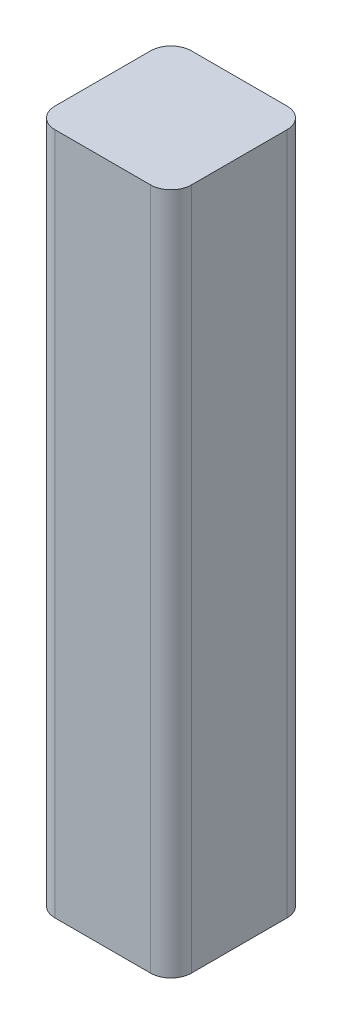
ISO-10303-21;
HEADER;
FILE_DESCRIPTION(('STEP AP214'),'2;1');
FILE_NAME('part.step','',(''),(''),'','','');
FILE_SCHEMA(('AUTOMOTIVE_DESIGN { 1 0 10303 214 1 1 1 1 }'));
ENDSEC;
DATA;
#1=APPLICATION_CONTEXT('core data for automotive mechanical design processes');
#2=APPLICATION_PROTOCOL_DEFINITION('international standard','automotive_design',2000,#1);
#3=PRODUCT_CONTEXT('',#1,'mechanical');
#4=PRODUCT('Part','Part','',(#3));
#5=PRODUCT_RELATED_PRODUCT_CATEGORY('part','',(#4));
#6=PRODUCT_DEFINITION_FORMATION('','',#4);
#7=PRODUCT_DEFINITION_CONTEXT('part definition',#1,'design');
#8=PRODUCT_DEFINITION('design','',#6,#7);
#9=PRODUCT_DEFINITION_SHAPE('','',#8);
#10=(LENGTH_UNIT() NAMED_UNIT(*) SI_UNIT(.MILLI.,.METRE.));
#11=(NAMED_UNIT(*) PLANE_ANGLE_UNIT() SI_UNIT($,.RADIAN.));
#12=(NAMED_UNIT(*) SI_UNIT($,.STERADIAN.) SOLID_ANGLE_UNIT());
#13=UNCERTAINTY_MEASURE_WITH_UNIT(LENGTH_MEASURE(1.E-05),#10,'distance_accuracy_value','');
#14=(GEOMETRIC_REPRESENTATION_CONTEXT(3) GLOBAL_UNCERTAINTY_ASSIGNED_CONTEXT((#13)) GLOBAL_UNIT_ASSIGNED_CONTEXT((#10,
#11,#12)) REPRESENTATION_CONTEXT('',''));
#15=CARTESIAN_POINT('',(0.,0.,0.));
#16=DIRECTION('',(0.,0.,1.));
#17=DIRECTION('',(1.,0.,0.));
#18=AXIS2_PLACEMENT_3D('',#15,#16,#17);
#19=CARTESIAN_POINT('',(-10.,100.,10.));
#20=DIRECTION('',(1.,0.,0.));
#21=DIRECTION('',(0.,0.,-1.));
#22=AXIS2_PLACEMENT_3D('',#19,#20,#21);
#23=PLANE('',#22);
#24=DIRECTION('',(0.,0.,1.));
#25=VECTOR('',#24,1.);
#26=CARTESIAN_POINT('',(-10.,0.,10.));
#27=LINE('',#26,#25);
#28=CARTESIAN_POINT('',(-10.,0.,-7.));
#29=VERTEX_POINT('',#28);
#30=CARTESIAN_POINT('',(-10.,0.,7.));
#31=VERTEX_POINT('',#30);
#32=EDGE_CURVE('E182',#29,#31,#27,.T.);
#33=ORIENTED_EDGE('',*,*,#32,.T.);
#34=DIRECTION('',(0.,-1.,0.));
#35=VECTOR('',#34,1.);
#36=CARTESIAN_POINT('',(-10.,100.,7.));
#37=LINE('',#36,#35);
#38=CARTESIAN_POINT('',(-10.,100.,7.));
#39=VERTEX_POINT('',#38);
#40=EDGE_CURVE('E11',#31,#39,#37,.F.);
#41=ORIENTED_EDGE('',*,*,#40,.T.);
#42=DIRECTION('',(0.,0.,1.));
#43=VECTOR('',#42,1.);
#44=CARTESIAN_POINT('',(-10.,100.,10.));
#45=LINE('',#44,#43);
#46=CARTESIAN_POINT('',(-10.,100.,-7.));
#47=VERTEX_POINT('',#46);
#48=EDGE_CURVE('E135',#47,#39,#45,.T.);
#49=ORIENTED_EDGE('',*,*,#48,.F.);
#50=DIRECTION('',(0.,-1.,0.));
#51=VECTOR('',#50,1.);
#52=CARTESIAN_POINT('',(-10.,100.,-7.));
#53=LINE('',#52,#51);
#54=EDGE_CURVE('E48',#47,#29,#53,.T.);
#55=ORIENTED_EDGE('',*,*,#54,.T.);
#56=EDGE_LOOP('',(#33,#41,#49,#55));
#57=FACE_BOUND('',#56,.T.);
#58=ADVANCED_FACE('F39',(#57),#23,.F.);
#59=CARTESIAN_POINT('',(10.,100.,10.));
#60=DIRECTION('',(0.,0.,-1.));
#61=DIRECTION('',(-1.,0.,0.));
#62=AXIS2_PLACEMENT_3D('',#59,#60,#61);
#63=PLANE('',#62);
#64=DIRECTION('',(1.,0.,0.));
#65=VECTOR('',#64,1.);
#66=CARTESIAN_POINT('',(10.,0.,10.));
#67=LINE('',#66,#65);
#68=CARTESIAN_POINT('',(-7.,0.,10.));
#69=VERTEX_POINT('',#68);
#70=CARTESIAN_POINT('',(7.,0.,10.));
#71=VERTEX_POINT('',#70);
#72=EDGE_CURVE('E142',#69,#71,#67,.T.);
#73=ORIENTED_EDGE('',*,*,#72,.T.);
#74=DIRECTION('',(0.,-1.,0.));
#75=VECTOR('',#74,1.);
#76=CARTESIAN_POINT('',(7.,100.,10.));
#77=LINE('',#76,#75);
#78=CARTESIAN_POINT('',(7.,100.,10.));
#79=VERTEX_POINT('',#78);
#80=EDGE_CURVE('E55',#71,#79,#77,.F.);
#81=ORIENTED_EDGE('',*,*,#80,.T.);
#82=DIRECTION('',(1.,0.,0.));
#83=VECTOR('',#82,1.);
#84=CARTESIAN_POINT('',(10.,100.,10.));
#85=LINE('',#84,#83);
#86=CARTESIAN_POINT('',(-7.,100.,10.));
#87=VERTEX_POINT('',#86);
#88=EDGE_CURVE('E140',#87,#79,#85,.T.);
#89=ORIENTED_EDGE('',*,*,#88,.F.);
#90=DIRECTION('',(0.,-1.,0.));
#91=VECTOR('',#90,1.);
#92=CARTESIAN_POINT('',(-7.,100.,10.));
#93=LINE('',#92,#91);
#94=EDGE_CURVE('E171',#87,#69,#93,.T.);
#95=ORIENTED_EDGE('',*,*,#94,.T.);
#96=EDGE_LOOP('',(#73,#81,#89,#95));
#97=FACE_BOUND('',#96,.T.);
#98=ADVANCED_FACE('F207',(#97),#63,.F.);
#99=CARTESIAN_POINT('',(10.,100.,10.));
#100=DIRECTION('',(-1.,0.,0.));
#101=DIRECTION('',(0.,0.,1.));
#102=AXIS2_PLACEMENT_3D('',#99,#100,#101);
#103=PLANE('',#102);
#104=DIRECTION('',(0.,0.,-1.));
#105=VECTOR('',#104,1.);
#106=CARTESIAN_POINT('',(10.,0.,10.));
#107=LINE('',#106,#105);
#108=CARTESIAN_POINT('',(10.,0.,7.));
#109=VERTEX_POINT('',#108);
#110=CARTESIAN_POINT('',(10.,0.,-7.));
#111=VERTEX_POINT('',#110);
#112=EDGE_CURVE('E136',#109,#111,#107,.T.);
#113=ORIENTED_EDGE('',*,*,#112,.T.);
#114=DIRECTION('',(0.,-1.,0.));
#115=VECTOR('',#114,1.);
#116=CARTESIAN_POINT('',(10.,100.,-7.));
#117=LINE('',#116,#115);
#118=CARTESIAN_POINT('',(10.,100.,-7.));
#119=VERTEX_POINT('',#118);
#120=EDGE_CURVE('E111',#111,#119,#117,.F.);
#121=ORIENTED_EDGE('',*,*,#120,.T.);
#122=DIRECTION('',(0.,0.,-1.));
#123=VECTOR('',#122,1.);
#124=CARTESIAN_POINT('',(10.,100.,10.));
#125=LINE('',#124,#123);
#126=CARTESIAN_POINT('',(10.,100.,7.));
#127=VERTEX_POINT('',#126);
#128=EDGE_CURVE('E193',#127,#119,#125,.T.);
#129=ORIENTED_EDGE('',*,*,#128,.F.);
#130=DIRECTION('',(0.,-1.,0.));
#131=VECTOR('',#130,1.);
#132=CARTESIAN_POINT('',(10.,100.,7.));
#133=LINE('',#132,#131);
#134=EDGE_CURVE('E117',#127,#109,#133,.T.);
#135=ORIENTED_EDGE('',*,*,#134,.T.);
#136=EDGE_LOOP('',(#113,#121,#129,#135));
#137=FACE_BOUND('',#136,.T.);
#138=ADVANCED_FACE('F206',(#137),#103,.F.);
#139=CARTESIAN_POINT('',(10.,100.,-10.));
#140=DIRECTION('',(0.,0.,1.));
#141=DIRECTION('',(1.,0.,0.));
#142=AXIS2_PLACEMENT_3D('',#139,#140,#141);
#143=PLANE('',#142);
#144=DIRECTION('',(-1.,0.,0.));
#145=VECTOR('',#144,1.);
#146=CARTESIAN_POINT('',(10.,100.,-10.));
#147=LINE('',#146,#145);
#148=CARTESIAN_POINT('',(7.,100.,-10.));
#149=VERTEX_POINT('',#148);
#150=CARTESIAN_POINT('',(-7.,100.,-10.));
#151=VERTEX_POINT('',#150);
#152=EDGE_CURVE('E127',#149,#151,#147,.T.);
#153=ORIENTED_EDGE('',*,*,#152,.F.);
#154=DIRECTION('',(0.,-1.,0.));
#155=VECTOR('',#154,1.);
#156=CARTESIAN_POINT('',(7.,100.,-10.));
#157=LINE('',#156,#155);
#158=CARTESIAN_POINT('',(7.,0.,-10.));
#159=VERTEX_POINT('',#158);
#160=EDGE_CURVE('E110',#149,#159,#157,.T.);
#161=ORIENTED_EDGE('',*,*,#160,.T.);
#162=DIRECTION('',(-1.,0.,0.));
#163=VECTOR('',#162,1.);
#164=CARTESIAN_POINT('',(10.,0.,-10.));
#165=LINE('',#164,#163);
#166=CARTESIAN_POINT('',(-7.,0.,-10.));
#167=VERTEX_POINT('',#166);
#168=EDGE_CURVE('E124',#159,#167,#165,.T.);
#169=ORIENTED_EDGE('',*,*,#168,.T.);
#170=DIRECTION('',(0.,-1.,0.));
#171=VECTOR('',#170,1.);
#172=CARTESIAN_POINT('',(-7.,100.,-10.));
#173=LINE('',#172,#171);
#174=EDGE_CURVE('E130',#167,#151,#173,.F.);
#175=ORIENTED_EDGE('',*,*,#174,.T.);
#176=EDGE_LOOP('',(#153,#161,#169,#175));
#177=FACE_BOUND('',#176,.T.);
#178=ADVANCED_FACE('F123',(#177),#143,.F.);
#179=CARTESIAN_POINT('',(0.,100.,0.));
#180=DIRECTION('',(0.,1.,0.));
#181=DIRECTION('',(0.,0.,1.));
#182=AXIS2_PLACEMENT_3D('',#179,#180,#181);
#183=PLANE('',#182);
#184=ORIENTED_EDGE('',*,*,#128,.T.);
#185=CARTESIAN_POINT('',(7.,100.,-7.));
#186=DIRECTION('',(0.,1.,0.));
#187=DIRECTION('',(0.,0.,1.));
#188=AXIS2_PLACEMENT_3D('',#185,#186,#187);
#189=CIRCLE('',#188,3.);
#190=EDGE_CURVE('E168',#119,#149,#189,.T.);
#191=ORIENTED_EDGE('',*,*,#190,.T.);
#192=ORIENTED_EDGE('',*,*,#152,.T.);
#193=CARTESIAN_POINT('',(-7.,100.,-7.));
#194=DIRECTION('',(0.,1.,0.));
#195=DIRECTION('',(0.,0.,1.));
#196=AXIS2_PLACEMENT_3D('',#193,#194,#195);
#197=CIRCLE('',#196,3.);
#198=EDGE_CURVE('E160',#151,#47,#197,.T.);
#199=ORIENTED_EDGE('',*,*,#198,.T.);
#200=ORIENTED_EDGE('',*,*,#48,.T.);
#201=CARTESIAN_POINT('',(-7.,100.,7.));
#202=DIRECTION('',(0.,1.,0.));
#203=DIRECTION('',(0.,0.,1.));
#204=AXIS2_PLACEMENT_3D('',#201,#202,#203);
#205=CIRCLE('',#204,3.);
#206=EDGE_CURVE('E62',#39,#87,#205,.T.);
#207=ORIENTED_EDGE('',*,*,#206,.T.);
#208=ORIENTED_EDGE('',*,*,#88,.T.);
#209=CARTESIAN_POINT('',(7.,100.,7.));
#210=DIRECTION('',(0.,1.,0.));
#211=DIRECTION('',(0.,0.,1.));
#212=AXIS2_PLACEMENT_3D('',#209,#210,#211);
#213=CIRCLE('',#212,3.);
#214=EDGE_CURVE('E165',#79,#127,#213,.T.);
#215=ORIENTED_EDGE('',*,*,#214,.T.);
#216=EDGE_LOOP('',(#184,#191,#192,#199,#200,#207,#208,#215));
#217=FACE_BOUND('',#216,.T.);
#218=ADVANCED_FACE('F199',(#217),#183,.T.);
#219=CARTESIAN_POINT('',(0.,0.,0.));
#220=DIRECTION('',(0.,1.,0.));
#221=DIRECTION('',(0.,0.,1.));
#222=AXIS2_PLACEMENT_3D('',#219,#220,#221);
#223=PLANE('',#222);
#224=ORIENTED_EDGE('',*,*,#168,.F.);
#225=CARTESIAN_POINT('',(7.,0.,-7.));
#226=DIRECTION('',(0.,1.,0.));
#227=DIRECTION('',(0.,0.,1.));
#228=AXIS2_PLACEMENT_3D('',#225,#226,#227);
#229=CIRCLE('',#228,3.);
#230=EDGE_CURVE('E106',#159,#111,#229,.F.);
#231=ORIENTED_EDGE('',*,*,#230,.T.);
#232=ORIENTED_EDGE('',*,*,#112,.F.);
#233=CARTESIAN_POINT('',(7.,0.,7.));
#234=DIRECTION('',(0.,1.,0.));
#235=DIRECTION('',(0.,0.,1.));
#236=AXIS2_PLACEMENT_3D('',#233,#234,#235);
#237=CIRCLE('',#236,3.);
#238=EDGE_CURVE('E118',#109,#71,#237,.F.);
#239=ORIENTED_EDGE('',*,*,#238,.T.);
#240=ORIENTED_EDGE('',*,*,#72,.F.);
#241=CARTESIAN_POINT('',(-7.,0.,7.));
#242=DIRECTION('',(0.,1.,0.));
#243=DIRECTION('',(0.,0.,1.));
#244=AXIS2_PLACEMENT_3D('',#241,#242,#243);
#245=CIRCLE('',#244,3.);
#246=EDGE_CURVE('E150',#69,#31,#245,.F.);
#247=ORIENTED_EDGE('',*,*,#246,.T.);
#248=ORIENTED_EDGE('',*,*,#32,.F.);
#249=CARTESIAN_POINT('',(-7.,0.,-7.));
#250=DIRECTION('',(0.,1.,0.));
#251=DIRECTION('',(0.,0.,1.));
#252=AXIS2_PLACEMENT_3D('',#249,#250,#251);
#253=CIRCLE('',#252,3.);
#254=EDGE_CURVE('E129',#29,#167,#253,.F.);
#255=ORIENTED_EDGE('',*,*,#254,.T.);
#256=EDGE_LOOP('',(#224,#231,#232,#239,#240,#247,#248,#255));
#257=FACE_BOUND('',#256,.T.);
#258=ADVANCED_FACE('F132',(#257),#223,.F.);
#259=CARTESIAN_POINT('',(7.,100.,-7.));
#260=DIRECTION('',(0.,-1.,0.));
#261=DIRECTION('',(0.,0.,-1.));
#262=AXIS2_PLACEMENT_3D('',#259,#260,#261);
#263=CYLINDRICAL_SURFACE('',#262,3.);
#264=ORIENTED_EDGE('',*,*,#190,.F.);
#265=ORIENTED_EDGE('',*,*,#120,.F.);
#266=ORIENTED_EDGE('',*,*,#230,.F.);
#267=ORIENTED_EDGE('',*,*,#160,.F.);
#268=EDGE_LOOP('',(#264,#265,#266,#267));
#269=FACE_BOUND('',#268,.T.);
#270=ADVANCED_FACE('F109',(#269),#263,.T.);
#271=CARTESIAN_POINT('',(7.,100.,7.));
#272=DIRECTION('',(0.,-1.,0.));
#273=DIRECTION('',(0.,0.,-1.));
#274=AXIS2_PLACEMENT_3D('',#271,#272,#273);
#275=CYLINDRICAL_SURFACE('',#274,3.);
#276=ORIENTED_EDGE('',*,*,#214,.F.);
#277=ORIENTED_EDGE('',*,*,#80,.F.);
#278=ORIENTED_EDGE('',*,*,#238,.F.);
#279=ORIENTED_EDGE('',*,*,#134,.F.);
#280=EDGE_LOOP('',(#276,#277,#278,#279));
#281=FACE_BOUND('',#280,.T.);
#282=ADVANCED_FACE('F204',(#281),#275,.T.);
#283=CARTESIAN_POINT('',(-7.,100.,7.));
#284=DIRECTION('',(0.,-1.,0.));
#285=DIRECTION('',(0.,0.,-1.));
#286=AXIS2_PLACEMENT_3D('',#283,#284,#285);
#287=CYLINDRICAL_SURFACE('',#286,3.);
#288=ORIENTED_EDGE('',*,*,#206,.F.);
#289=ORIENTED_EDGE('',*,*,#40,.F.);
#290=ORIENTED_EDGE('',*,*,#246,.F.);
#291=ORIENTED_EDGE('',*,*,#94,.F.);
#292=EDGE_LOOP('',(#288,#289,#290,#291));
#293=FACE_BOUND('',#292,.T.);
#294=ADVANCED_FACE('F209',(#293),#287,.T.);
#295=CARTESIAN_POINT('',(-7.,100.,-7.));
#296=DIRECTION('',(0.,-1.,0.));
#297=DIRECTION('',(0.,0.,-1.));
#298=AXIS2_PLACEMENT_3D('',#295,#296,#297);
#299=CYLINDRICAL_SURFACE('',#298,3.);
#300=ORIENTED_EDGE('',*,*,#198,.F.);
#301=ORIENTED_EDGE('',*,*,#174,.F.);
#302=ORIENTED_EDGE('',*,*,#254,.F.);
#303=ORIENTED_EDGE('',*,*,#54,.F.);
#304=EDGE_LOOP('',(#300,#301,#302,#303));
#305=FACE_BOUND('',#304,.T.);
#306=ADVANCED_FACE('F41',(#305),#299,.T.);
#307=CLOSED_SHELL('',(#58,#98,#138,#178,#218,#258,#270,#282,#294,#306));
#308=MANIFOLD_SOLID_BREP('B2',#307);
#309=ADVANCED_BREP_SHAPE_REPRESENTATION('',(#18,#308),#14);
#310=SHAPE_DEFINITION_REPRESENTATION(#9,#309);
ENDSEC;
END-ISO-10303-21;
